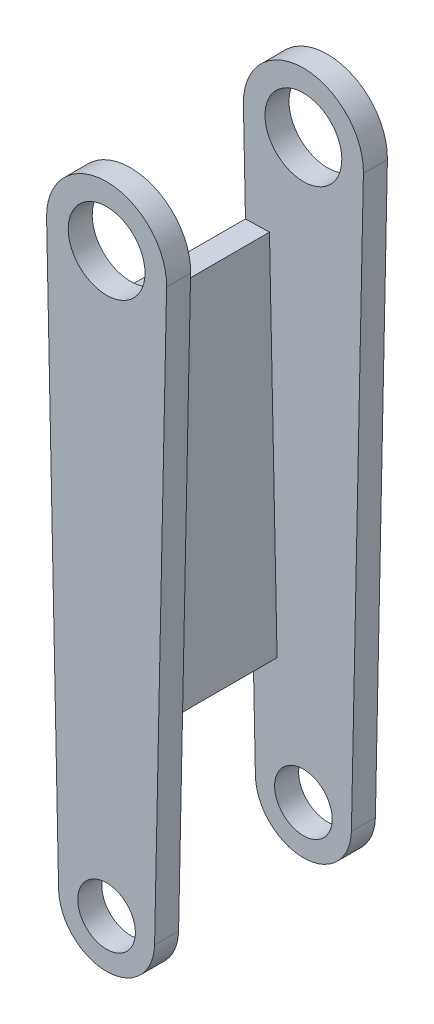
ISO-10303-21;
HEADER;
FILE_DESCRIPTION(('STEP AP214'),'2;1');
FILE_NAME('part.step','',(''),(''),'','','');
FILE_SCHEMA(('AUTOMOTIVE_DESIGN { 1 0 10303 214 1 1 1 1 }'));
ENDSEC;
DATA;
#1=APPLICATION_CONTEXT('core data for automotive mechanical design processes');
#2=APPLICATION_PROTOCOL_DEFINITION('international standard','automotive_design',2000,#1);
#3=PRODUCT_CONTEXT('',#1,'mechanical');
#4=PRODUCT('Part','Part','',(#3));
#5=PRODUCT_RELATED_PRODUCT_CATEGORY('part','',(#4));
#6=PRODUCT_DEFINITION_FORMATION('','',#4);
#7=PRODUCT_DEFINITION_CONTEXT('part definition',#1,'design');
#8=PRODUCT_DEFINITION('design','',#6,#7);
#9=PRODUCT_DEFINITION_SHAPE('','',#8);
#10=(LENGTH_UNIT() NAMED_UNIT(*) SI_UNIT(.MILLI.,.METRE.));
#11=(NAMED_UNIT(*) PLANE_ANGLE_UNIT() SI_UNIT($,.RADIAN.));
#12=(NAMED_UNIT(*) SI_UNIT($,.STERADIAN.) SOLID_ANGLE_UNIT());
#13=UNCERTAINTY_MEASURE_WITH_UNIT(LENGTH_MEASURE(1.E-05),#10,'distance_accuracy_value','');
#14=(GEOMETRIC_REPRESENTATION_CONTEXT(3) GLOBAL_UNCERTAINTY_ASSIGNED_CONTEXT((#13)) GLOBAL_UNIT_ASSIGNED_CONTEXT((#10,
#11,#12)) REPRESENTATION_CONTEXT('',''));
#15=CARTESIAN_POINT('',(0.,0.,0.));
#16=DIRECTION('',(0.,0.,1.));
#17=DIRECTION('',(1.,0.,0.));
#18=AXIS2_PLACEMENT_3D('',#15,#16,#17);
#19=CARTESIAN_POINT('',(0.,120.,46.));
#20=DIRECTION('',(0.,0.,-1.));
#21=DIRECTION('',(-1.,0.,0.));
#22=AXIS2_PLACEMENT_3D('',#19,#20,#21);
#23=CYLINDRICAL_SURFACE('',#22,12.5);
#24=CARTESIAN_POINT('',(0.,120.,5.));
#25=DIRECTION('',(0.,0.,1.));
#26=DIRECTION('',(0.,-1.,0.));
#27=AXIS2_PLACEMENT_3D('',#24,#25,#26);
#28=CIRCLE('',#27,12.5);
#29=CARTESIAN_POINT('',(12.4972870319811,119.739583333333,5.));
#30=VERTEX_POINT('',#29);
#31=CARTESIAN_POINT('',(-12.4972870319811,119.739583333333,5.));
#32=VERTEX_POINT('',#31);
#33=EDGE_CURVE('E216',#30,#32,#28,.T.);
#34=ORIENTED_EDGE('',*,*,#33,.F.);
#35=DIRECTION('',(0.,0.,-1.));
#36=VECTOR('',#35,1.);
#37=CARTESIAN_POINT('',(12.4972870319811,119.739583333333,46.));
#38=LINE('',#37,#36);
#39=CARTESIAN_POINT('',(12.4972870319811,119.739583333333,0.));
#40=VERTEX_POINT('',#39);
#41=EDGE_CURVE('E41',#30,#40,#38,.T.);
#42=ORIENTED_EDGE('',*,*,#41,.T.);
#43=CARTESIAN_POINT('',(0.,120.,0.));
#44=DIRECTION('',(0.,0.,1.));
#45=DIRECTION('',(1.,0.,0.));
#46=AXIS2_PLACEMENT_3D('',#43,#44,#45);
#47=CIRCLE('',#46,12.5);
#48=CARTESIAN_POINT('',(-12.4972870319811,119.739583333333,0.));
#49=VERTEX_POINT('',#48);
#50=EDGE_CURVE('E208',#40,#49,#47,.T.);
#51=ORIENTED_EDGE('',*,*,#50,.T.);
#52=DIRECTION('',(0.,0.,-1.));
#53=VECTOR('',#52,1.);
#54=CARTESIAN_POINT('',(-12.4972870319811,119.739583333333,46.));
#55=LINE('',#54,#53);
#56=EDGE_CURVE('E207',#32,#49,#55,.T.);
#57=ORIENTED_EDGE('',*,*,#56,.F.);
#58=EDGE_LOOP('',(#34,#42,#51,#57));
#59=FACE_BOUND('',#58,.T.);
#60=ADVANCED_FACE('F37',(#59),#23,.T.);
#61=CARTESIAN_POINT('',(-9.99782962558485,-0.208333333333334,46.));
#62=DIRECTION('',(0.999782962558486,0.0208333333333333,0.));
#63=DIRECTION('',(-0.0208333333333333,0.999782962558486,0.));
#64=AXIS2_PLACEMENT_3D('',#61,#62,#63);
#65=PLANE('',#64);
#66=DIRECTION('',(0.0208333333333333,-0.999782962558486,0.));
#67=VECTOR('',#66,1.);
#68=CARTESIAN_POINT('',(-9.99782962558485,-0.208333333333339,5.00000000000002));
#69=LINE('',#68,#67);
#70=CARTESIAN_POINT('',(-12.0702036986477,99.2440326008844,5.));
#71=VERTEX_POINT('',#70);
#72=EDGE_CURVE('E46',#32,#71,#69,.T.);
#73=ORIENTED_EDGE('',*,*,#72,.F.);
#74=ORIENTED_EDGE('',*,*,#56,.T.);
#75=DIRECTION('',(0.0208333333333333,-0.999782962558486,0.));
#76=VECTOR('',#75,1.);
#77=CARTESIAN_POINT('',(-9.99782962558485,-0.208333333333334,0.));
#78=LINE('',#77,#76);
#79=CARTESIAN_POINT('',(-9.99782962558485,-0.208333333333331,0.));
#80=VERTEX_POINT('',#79);
#81=EDGE_CURVE('E204',#49,#80,#78,.T.);
#82=ORIENTED_EDGE('',*,*,#81,.T.);
#83=DIRECTION('',(0.,0.,-1.));
#84=VECTOR('',#83,1.);
#85=CARTESIAN_POINT('',(-9.99782962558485,-0.208333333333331,46.));
#86=LINE('',#85,#84);
#87=CARTESIAN_POINT('',(-9.99782962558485,-0.208333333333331,5.00000000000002));
#88=VERTEX_POINT('',#87);
#89=EDGE_CURVE('E203',#88,#80,#86,.T.);
#90=ORIENTED_EDGE('',*,*,#89,.F.);
#91=CARTESIAN_POINT('',(-10.4868703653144,23.2605274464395,5.00000000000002));
#92=VERTEX_POINT('',#91);
#93=EDGE_CURVE('E218',#92,#88,#69,.T.);
#94=ORIENTED_EDGE('',*,*,#93,.F.);
#95=DIRECTION('',(0.,0.,1.));
#96=VECTOR('',#95,1.);
#97=CARTESIAN_POINT('',(-10.4868703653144,23.2605274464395,5.00000000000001));
#98=LINE('',#97,#96);
#99=CARTESIAN_POINT('',(-10.4868703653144,23.2605274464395,41.));
#100=VERTEX_POINT('',#99);
#101=EDGE_CURVE('E54',#92,#100,#98,.T.);
#102=ORIENTED_EDGE('',*,*,#101,.T.);
#103=DIRECTION('',(-0.0208333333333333,0.999782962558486,0.));
#104=VECTOR('',#103,1.);
#105=CARTESIAN_POINT('',(-9.99782962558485,-0.208333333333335,41.));
#106=LINE('',#105,#104);
#107=CARTESIAN_POINT('',(-9.99782962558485,-0.208333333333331,41.));
#108=VERTEX_POINT('',#107);
#109=EDGE_CURVE('E257',#108,#100,#106,.T.);
#110=ORIENTED_EDGE('',*,*,#109,.F.);
#111=DIRECTION('',(0.,0.,-1.));
#112=VECTOR('',#111,1.);
#113=CARTESIAN_POINT('',(-9.99782962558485,-0.208333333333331,46.));
#114=LINE('',#113,#112);
#115=CARTESIAN_POINT('',(-9.99782962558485,-0.208333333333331,46.));
#116=VERTEX_POINT('',#115);
#117=EDGE_CURVE('E149',#116,#108,#114,.T.);
#118=ORIENTED_EDGE('',*,*,#117,.F.);
#119=DIRECTION('',(0.0208333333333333,-0.999782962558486,0.));
#120=VECTOR('',#119,1.);
#121=CARTESIAN_POINT('',(-9.99782962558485,-0.208333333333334,46.));
#122=LINE('',#121,#120);
#123=CARTESIAN_POINT('',(-12.4972870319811,119.739583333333,46.));
#124=VERTEX_POINT('',#123);
#125=EDGE_CURVE('E271',#124,#116,#122,.T.);
#126=ORIENTED_EDGE('',*,*,#125,.F.);
#127=DIRECTION('',(0.,0.,-1.));
#128=VECTOR('',#127,1.);
#129=CARTESIAN_POINT('',(-12.4972870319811,119.739583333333,46.));
#130=LINE('',#129,#128);
#131=CARTESIAN_POINT('',(-12.4972870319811,119.739583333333,41.));
#132=VERTEX_POINT('',#131);
#133=EDGE_CURVE('E157',#124,#132,#130,.T.);
#134=ORIENTED_EDGE('',*,*,#133,.T.);
#135=CARTESIAN_POINT('',(-12.0702036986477,99.2440326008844,41.));
#136=VERTEX_POINT('',#135);
#137=EDGE_CURVE('E150',#136,#132,#106,.T.);
#138=ORIENTED_EDGE('',*,*,#137,.F.);
#139=DIRECTION('',(0.,0.,-1.));
#140=VECTOR('',#139,1.);
#141=CARTESIAN_POINT('',(-12.0702036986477,99.2440326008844,5.));
#142=LINE('',#141,#140);
#143=EDGE_CURVE('E170',#136,#71,#142,.T.);
#144=ORIENTED_EDGE('',*,*,#143,.T.);
#145=EDGE_LOOP('',(#73,#74,#82,#90,#94,#102,#110,#118,#126,#134,#138,#144));
#146=FACE_BOUND('',#145,.T.);
#147=ADVANCED_FACE('F247',(#146),#65,.F.);
#148=CARTESIAN_POINT('',(0.,0.,46.));
#149=DIRECTION('',(0.,0.,-1.));
#150=DIRECTION('',(-1.,0.,0.));
#151=AXIS2_PLACEMENT_3D('',#148,#149,#150);
#152=CYLINDRICAL_SURFACE('',#151,10.);
#153=CARTESIAN_POINT('',(0.,0.,5.00000000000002));
#154=DIRECTION('',(0.,0.,1.));
#155=DIRECTION('',(0.,-1.,0.));
#156=AXIS2_PLACEMENT_3D('',#153,#154,#155);
#157=CIRCLE('',#156,10.);
#158=CARTESIAN_POINT('',(9.99782962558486,-0.208333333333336,5.00000000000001));
#159=VERTEX_POINT('',#158);
#160=EDGE_CURVE('E11',#88,#159,#157,.T.);
#161=ORIENTED_EDGE('',*,*,#160,.F.);
#162=ORIENTED_EDGE('',*,*,#89,.T.);
#163=CARTESIAN_POINT('',(0.,0.,0.));
#164=DIRECTION('',(0.,0.,1.));
#165=DIRECTION('',(1.,0.,0.));
#166=AXIS2_PLACEMENT_3D('',#163,#164,#165);
#167=CIRCLE('',#166,10.);
#168=CARTESIAN_POINT('',(9.99782962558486,-0.208333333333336,0.));
#169=VERTEX_POINT('',#168);
#170=EDGE_CURVE('E200',#80,#169,#167,.T.);
#171=ORIENTED_EDGE('',*,*,#170,.T.);
#172=DIRECTION('',(0.,0.,-1.));
#173=VECTOR('',#172,1.);
#174=CARTESIAN_POINT('',(9.99782962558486,-0.208333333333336,46.));
#175=LINE('',#174,#173);
#176=EDGE_CURVE('E199',#159,#169,#175,.T.);
#177=ORIENTED_EDGE('',*,*,#176,.F.);
#178=EDGE_LOOP('',(#161,#162,#171,#177));
#179=FACE_BOUND('',#178,.T.);
#180=ADVANCED_FACE('F234',(#179),#152,.T.);
#181=CARTESIAN_POINT('',(12.4972870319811,119.739583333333,46.));
#182=DIRECTION('',(-0.999782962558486,0.0208333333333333,0.));
#183=DIRECTION('',(-0.0208333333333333,-0.999782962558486,0.));
#184=AXIS2_PLACEMENT_3D('',#181,#182,#183);
#185=PLANE('',#184);
#186=DIRECTION('',(-0.0208333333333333,-0.999782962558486,0.));
#187=VECTOR('',#186,1.);
#188=CARTESIAN_POINT('',(13.4468325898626,165.307877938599,5.));
#189=LINE('',#188,#187);
#190=EDGE_CURVE('E61',#30,#159,#189,.T.);
#191=ORIENTED_EDGE('',*,*,#190,.T.);
#192=ORIENTED_EDGE('',*,*,#176,.T.);
#193=DIRECTION('',(0.0208333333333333,0.999782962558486,0.));
#194=VECTOR('',#193,1.);
#195=CARTESIAN_POINT('',(12.4972870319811,119.739583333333,0.));
#196=LINE('',#195,#194);
#197=EDGE_CURVE('E196',#169,#40,#196,.T.);
#198=ORIENTED_EDGE('',*,*,#197,.T.);
#199=ORIENTED_EDGE('',*,*,#41,.F.);
#200=EDGE_LOOP('',(#191,#192,#198,#199));
#201=FACE_BOUND('',#200,.T.);
#202=ADVANCED_FACE('F227',(#201),#185,.F.);
#203=CARTESIAN_POINT('',(0.,0.,46.));
#204=DIRECTION('',(0.,0.,-1.));
#205=DIRECTION('',(-1.,0.,0.));
#206=AXIS2_PLACEMENT_3D('',#203,#204,#205);
#207=CYLINDRICAL_SURFACE('',#206,6.);
#208=CARTESIAN_POINT('',(0.,0.,0.));
#209=DIRECTION('',(0.,0.,1.));
#210=DIRECTION('',(1.,0.,0.));
#211=AXIS2_PLACEMENT_3D('',#208,#209,#210);
#212=CIRCLE('',#211,6.);
#213=CARTESIAN_POINT('',(6.,0.,0.));
#214=VERTEX_POINT('',#213);
#215=EDGE_CURVE('E194',#214,#214,#212,.T.);
#216=ORIENTED_EDGE('',*,*,#215,.F.);
#217=EDGE_LOOP('',(#216));
#218=FACE_BOUND('',#217,.T.);
#219=CARTESIAN_POINT('',(0.,0.,5.00000000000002));
#220=DIRECTION('',(0.,0.,1.));
#221=DIRECTION('',(0.,-1.,0.));
#222=AXIS2_PLACEMENT_3D('',#219,#220,#221);
#223=CIRCLE('',#222,6.);
#224=CARTESIAN_POINT('',(0.,-6.,5.00000000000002));
#225=VERTEX_POINT('',#224);
#226=EDGE_CURVE('E195',#225,#225,#223,.T.);
#227=ORIENTED_EDGE('',*,*,#226,.T.);
#228=EDGE_LOOP('',(#227));
#229=FACE_BOUND('',#228,.T.);
#230=ADVANCED_FACE('F300',(#218,#229),#207,.F.);
#231=CARTESIAN_POINT('',(0.,120.,46.));
#232=DIRECTION('',(0.,0.,-1.));
#233=DIRECTION('',(-1.,0.,0.));
#234=AXIS2_PLACEMENT_3D('',#231,#232,#233);
#235=CYLINDRICAL_SURFACE('',#234,8.00000000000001);
#236=CARTESIAN_POINT('',(0.,120.,0.));
#237=DIRECTION('',(0.,0.,1.));
#238=DIRECTION('',(1.,0.,0.));
#239=AXIS2_PLACEMENT_3D('',#236,#237,#238);
#240=CIRCLE('',#239,8.00000000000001);
#241=CARTESIAN_POINT('',(8.00000000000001,120.,0.));
#242=VERTEX_POINT('',#241);
#243=EDGE_CURVE('E213',#242,#242,#240,.T.);
#244=ORIENTED_EDGE('',*,*,#243,.F.);
#245=EDGE_LOOP('',(#244));
#246=FACE_BOUND('',#245,.T.);
#247=CARTESIAN_POINT('',(0.,120.,5.));
#248=DIRECTION('',(0.,0.,1.));
#249=DIRECTION('',(0.,-1.,0.));
#250=AXIS2_PLACEMENT_3D('',#247,#248,#249);
#251=CIRCLE('',#250,8.00000000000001);
#252=CARTESIAN_POINT('',(0.,112.,5.00000000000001));
#253=VERTEX_POINT('',#252);
#254=EDGE_CURVE('E191',#253,#253,#251,.T.);
#255=ORIENTED_EDGE('',*,*,#254,.T.);
#256=EDGE_LOOP('',(#255));
#257=FACE_BOUND('',#256,.T.);
#258=ADVANCED_FACE('F39',(#246,#257),#235,.F.);
#259=CARTESIAN_POINT('',(0.,120.,0.));
#260=DIRECTION('',(0.,0.,1.));
#261=DIRECTION('',(1.,0.,0.));
#262=AXIS2_PLACEMENT_3D('',#259,#260,#261);
#263=PLANE('',#262);
#264=ORIENTED_EDGE('',*,*,#50,.F.);
#265=ORIENTED_EDGE('',*,*,#197,.F.);
#266=ORIENTED_EDGE('',*,*,#170,.F.);
#267=ORIENTED_EDGE('',*,*,#81,.F.);
#268=EDGE_LOOP('',(#264,#265,#266,#267));
#269=FACE_BOUND('',#268,.T.);
#270=ORIENTED_EDGE('',*,*,#215,.T.);
#271=EDGE_LOOP('',(#270));
#272=FACE_BOUND('',#271,.T.);
#273=ORIENTED_EDGE('',*,*,#243,.T.);
#274=EDGE_LOOP('',(#273));
#275=FACE_BOUND('',#274,.T.);
#276=ADVANCED_FACE('F238',(#269,#272,#275),#263,.F.);
#277=CARTESIAN_POINT('',(-83.5321147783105,167.328711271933,5.));
#278=DIRECTION('',(0.,0.,1.));
#279=DIRECTION('',(0.,-1.,0.));
#280=AXIS2_PLACEMENT_3D('',#277,#278,#279);
#281=PLANE('',#280);
#282=DIRECTION('',(-0.999782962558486,-0.0208333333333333,0.));
#283=VECTOR('',#282,1.);
#284=CARTESIAN_POINT('',(-7.07128888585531,99.3481992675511,5.));
#285=LINE('',#284,#283);
#286=CARTESIAN_POINT('',(-7.07128888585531,99.3481992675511,5.));
#287=VERTEX_POINT('',#286);
#288=EDGE_CURVE('E183',#287,#71,#285,.T.);
#289=ORIENTED_EDGE('',*,*,#288,.F.);
#290=DIRECTION('',(0.0208333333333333,-0.999782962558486,0.));
#291=VECTOR('',#290,1.);
#292=CARTESIAN_POINT('',(-7.07128888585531,99.3481992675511,5.));
#293=LINE('',#292,#291);
#294=CARTESIAN_POINT('',(-5.48795555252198,23.3646941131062,5.00000000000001));
#295=VERTEX_POINT('',#294);
#296=EDGE_CURVE('E166',#287,#295,#293,.T.);
#297=ORIENTED_EDGE('',*,*,#296,.T.);
#298=DIRECTION('',(-0.999782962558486,-0.0208333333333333,0.));
#299=VECTOR('',#298,1.);
#300=CARTESIAN_POINT('',(-5.48795555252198,23.3646941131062,5.00000000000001));
#301=LINE('',#300,#299);
#302=EDGE_CURVE('E179',#295,#92,#301,.T.);
#303=ORIENTED_EDGE('',*,*,#302,.T.);
#304=ORIENTED_EDGE('',*,*,#93,.T.);
#305=ORIENTED_EDGE('',*,*,#160,.T.);
#306=ORIENTED_EDGE('',*,*,#190,.F.);
#307=ORIENTED_EDGE('',*,*,#33,.T.);
#308=ORIENTED_EDGE('',*,*,#72,.T.);
#309=EDGE_LOOP('',(#289,#297,#303,#304,#305,#306,#307,#308));
#310=FACE_BOUND('',#309,.T.);
#311=ORIENTED_EDGE('',*,*,#254,.F.);
#312=EDGE_LOOP('',(#311));
#313=FACE_BOUND('',#312,.T.);
#314=ORIENTED_EDGE('',*,*,#226,.F.);
#315=EDGE_LOOP('',(#314));
#316=FACE_BOUND('',#315,.T.);
#317=ADVANCED_FACE('F244',(#310,#313,#316),#281,.T.);
#318=CARTESIAN_POINT('',(-7.07128888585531,99.3481992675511,5.));
#319=DIRECTION('',(-0.0208333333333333,0.999782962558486,0.));
#320=DIRECTION('',(-0.999782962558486,-0.0208333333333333,0.));
#321=AXIS2_PLACEMENT_3D('',#318,#319,#320);
#322=PLANE('',#321);
#323=ORIENTED_EDGE('',*,*,#143,.F.);
#324=DIRECTION('',(-0.999782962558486,-0.0208333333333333,0.));
#325=VECTOR('',#324,1.);
#326=CARTESIAN_POINT('',(-7.07128888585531,99.3481992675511,41.));
#327=LINE('',#326,#325);
#328=CARTESIAN_POINT('',(-7.07128888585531,99.3481992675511,41.));
#329=VERTEX_POINT('',#328);
#330=EDGE_CURVE('E185',#329,#136,#327,.T.);
#331=ORIENTED_EDGE('',*,*,#330,.F.);
#332=DIRECTION('',(0.,0.,-1.));
#333=VECTOR('',#332,1.);
#334=CARTESIAN_POINT('',(-7.07128888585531,99.3481992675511,5.));
#335=LINE('',#334,#333);
#336=EDGE_CURVE('E176',#329,#287,#335,.T.);
#337=ORIENTED_EDGE('',*,*,#336,.T.);
#338=ORIENTED_EDGE('',*,*,#288,.T.);
#339=EDGE_LOOP('',(#323,#331,#337,#338));
#340=FACE_BOUND('',#339,.T.);
#341=ADVANCED_FACE('F250',(#340),#322,.T.);
#342=CARTESIAN_POINT('',(-5.48795555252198,23.3646941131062,5.00000000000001));
#343=DIRECTION('',(0.0208333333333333,-0.999782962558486,0.));
#344=DIRECTION('',(0.999782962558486,0.0208333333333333,0.));
#345=AXIS2_PLACEMENT_3D('',#342,#343,#344);
#346=PLANE('',#345);
#347=ORIENTED_EDGE('',*,*,#101,.F.);
#348=ORIENTED_EDGE('',*,*,#302,.F.);
#349=DIRECTION('',(0.,0.,1.));
#350=VECTOR('',#349,1.);
#351=CARTESIAN_POINT('',(-5.48795555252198,23.3646941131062,5.00000000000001));
#352=LINE('',#351,#350);
#353=CARTESIAN_POINT('',(-5.48795555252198,23.3646941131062,41.));
#354=VERTEX_POINT('',#353);
#355=EDGE_CURVE('E169',#295,#354,#352,.T.);
#356=ORIENTED_EDGE('',*,*,#355,.T.);
#357=DIRECTION('',(-0.999782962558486,-0.0208333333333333,0.));
#358=VECTOR('',#357,1.);
#359=CARTESIAN_POINT('',(-5.48795555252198,23.3646941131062,41.));
#360=LINE('',#359,#358);
#361=EDGE_CURVE('E188',#354,#100,#360,.T.);
#362=ORIENTED_EDGE('',*,*,#361,.T.);
#363=EDGE_LOOP('',(#347,#348,#356,#362));
#364=FACE_BOUND('',#363,.T.);
#365=ADVANCED_FACE('F255',(#364),#346,.T.);
#366=CARTESIAN_POINT('',(-4.99891481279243,-0.104166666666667,0.));
#367=DIRECTION('',(-0.999782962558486,-0.0208333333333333,0.));
#368=DIRECTION('',(0.0208333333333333,-0.999782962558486,0.));
#369=AXIS2_PLACEMENT_3D('',#366,#367,#368);
#370=PLANE('',#369);
#371=ORIENTED_EDGE('',*,*,#296,.F.);
#372=ORIENTED_EDGE('',*,*,#336,.F.);
#373=DIRECTION('',(-0.0208333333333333,0.999782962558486,0.));
#374=VECTOR('',#373,1.);
#375=CARTESIAN_POINT('',(-7.07128888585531,99.3481992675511,41.));
#376=LINE('',#375,#374);
#377=EDGE_CURVE('E173',#354,#329,#376,.T.);
#378=ORIENTED_EDGE('',*,*,#377,.F.);
#379=ORIENTED_EDGE('',*,*,#355,.F.);
#380=EDGE_LOOP('',(#371,#372,#378,#379));
#381=FACE_BOUND('',#380,.T.);
#382=ADVANCED_FACE('F254',(#381),#370,.F.);
#383=CARTESIAN_POINT('',(-83.5321147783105,167.328711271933,41.));
#384=DIRECTION('',(0.,0.,-1.));
#385=DIRECTION('',(0.,1.,0.));
#386=AXIS2_PLACEMENT_3D('',#383,#384,#385);
#387=PLANE('',#386);
#388=CARTESIAN_POINT('',(0.,0.,41.));
#389=DIRECTION('',(0.,0.,-1.));
#390=DIRECTION('',(0.,1.,0.));
#391=AXIS2_PLACEMENT_3D('',#388,#389,#390);
#392=CIRCLE('',#391,6.);
#393=CARTESIAN_POINT('',(0.,6.,41.));
#394=VERTEX_POINT('',#393);
#395=EDGE_CURVE('E151',#394,#394,#392,.T.);
#396=ORIENTED_EDGE('',*,*,#395,.F.);
#397=EDGE_LOOP('',(#396));
#398=FACE_BOUND('',#397,.T.);
#399=CARTESIAN_POINT('',(0.,120.,41.));
#400=DIRECTION('',(0.,0.,-1.));
#401=DIRECTION('',(0.,1.,0.));
#402=AXIS2_PLACEMENT_3D('',#399,#400,#401);
#403=CIRCLE('',#402,8.00000000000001);
#404=CARTESIAN_POINT('',(0.,128.,41.));
#405=VERTEX_POINT('',#404);
#406=EDGE_CURVE('E139',#405,#405,#403,.T.);
#407=ORIENTED_EDGE('',*,*,#406,.F.);
#408=EDGE_LOOP('',(#407));
#409=FACE_BOUND('',#408,.T.);
#410=ORIENTED_EDGE('',*,*,#361,.F.);
#411=ORIENTED_EDGE('',*,*,#377,.T.);
#412=ORIENTED_EDGE('',*,*,#330,.T.);
#413=ORIENTED_EDGE('',*,*,#137,.T.);
#414=CARTESIAN_POINT('',(0.,120.,41.));
#415=DIRECTION('',(0.,0.,-1.));
#416=DIRECTION('',(0.,1.,0.));
#417=AXIS2_PLACEMENT_3D('',#414,#415,#416);
#418=CIRCLE('',#417,12.5);
#419=CARTESIAN_POINT('',(12.4972870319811,119.739583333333,41.));
#420=VERTEX_POINT('',#419);
#421=EDGE_CURVE('E134',#132,#420,#418,.T.);
#422=ORIENTED_EDGE('',*,*,#421,.T.);
#423=DIRECTION('',(0.0208333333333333,0.999782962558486,0.));
#424=VECTOR('',#423,1.);
#425=CARTESIAN_POINT('',(13.4468325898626,165.307877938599,41.));
#426=LINE('',#425,#424);
#427=CARTESIAN_POINT('',(9.99782962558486,-0.20833333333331,41.));
#428=VERTEX_POINT('',#427);
#429=EDGE_CURVE('E126',#428,#420,#426,.T.);
#430=ORIENTED_EDGE('',*,*,#429,.F.);
#431=CARTESIAN_POINT('',(0.,0.,41.));
#432=DIRECTION('',(0.,0.,-1.));
#433=DIRECTION('',(0.,1.,0.));
#434=AXIS2_PLACEMENT_3D('',#431,#432,#433);
#435=CIRCLE('',#434,10.);
#436=EDGE_CURVE('E131',#428,#108,#435,.T.);
#437=ORIENTED_EDGE('',*,*,#436,.T.);
#438=ORIENTED_EDGE('',*,*,#109,.T.);
#439=EDGE_LOOP('',(#410,#411,#412,#413,#422,#430,#437,#438));
#440=FACE_BOUND('',#439,.T.);
#441=ADVANCED_FACE('F129',(#398,#409,#440),#387,.T.);
#442=CARTESIAN_POINT('',(12.4972870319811,119.739583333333,46.));
#443=DIRECTION('',(-0.999782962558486,0.0208333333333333,0.));
#444=DIRECTION('',(-0.0208333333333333,-0.999782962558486,0.));
#445=AXIS2_PLACEMENT_3D('',#442,#443,#444);
#446=PLANE('',#445);
#447=ORIENTED_EDGE('',*,*,#429,.T.);
#448=DIRECTION('',(0.,0.,-1.));
#449=VECTOR('',#448,1.);
#450=CARTESIAN_POINT('',(12.4972870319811,119.739583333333,46.));
#451=LINE('',#450,#449);
#452=CARTESIAN_POINT('',(12.4972870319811,119.739583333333,46.));
#453=VERTEX_POINT('',#452);
#454=EDGE_CURVE('E155',#453,#420,#451,.T.);
#455=ORIENTED_EDGE('',*,*,#454,.F.);
#456=DIRECTION('',(0.0208333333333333,0.999782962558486,0.));
#457=VECTOR('',#456,1.);
#458=CARTESIAN_POINT('',(12.4972870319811,119.739583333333,46.));
#459=LINE('',#458,#457);
#460=CARTESIAN_POINT('',(9.99782962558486,-0.208333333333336,46.));
#461=VERTEX_POINT('',#460);
#462=EDGE_CURVE('E154',#461,#453,#459,.T.);
#463=ORIENTED_EDGE('',*,*,#462,.F.);
#464=DIRECTION('',(0.,0.,-1.));
#465=VECTOR('',#464,1.);
#466=CARTESIAN_POINT('',(9.99782962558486,-0.208333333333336,46.));
#467=LINE('',#466,#465);
#468=EDGE_CURVE('E146',#461,#428,#467,.T.);
#469=ORIENTED_EDGE('',*,*,#468,.T.);
#470=EDGE_LOOP('',(#447,#455,#463,#469));
#471=FACE_BOUND('',#470,.T.);
#472=ADVANCED_FACE('F153',(#471),#446,.F.);
#473=CARTESIAN_POINT('',(0.,0.,46.));
#474=DIRECTION('',(0.,0.,-1.));
#475=DIRECTION('',(-1.,0.,0.));
#476=AXIS2_PLACEMENT_3D('',#473,#474,#475);
#477=CYLINDRICAL_SURFACE('',#476,10.);
#478=ORIENTED_EDGE('',*,*,#436,.F.);
#479=ORIENTED_EDGE('',*,*,#468,.F.);
#480=CARTESIAN_POINT('',(0.,0.,46.));
#481=DIRECTION('',(0.,0.,1.));
#482=DIRECTION('',(1.,0.,0.));
#483=AXIS2_PLACEMENT_3D('',#480,#481,#482);
#484=CIRCLE('',#483,10.);
#485=EDGE_CURVE('E273',#116,#461,#484,.T.);
#486=ORIENTED_EDGE('',*,*,#485,.F.);
#487=ORIENTED_EDGE('',*,*,#117,.T.);
#488=EDGE_LOOP('',(#478,#479,#486,#487));
#489=FACE_BOUND('',#488,.T.);
#490=ADVANCED_FACE('F144',(#489),#477,.T.);
#491=CARTESIAN_POINT('',(0.,120.,46.));
#492=DIRECTION('',(0.,0.,-1.));
#493=DIRECTION('',(-1.,0.,0.));
#494=AXIS2_PLACEMENT_3D('',#491,#492,#493);
#495=CYLINDRICAL_SURFACE('',#494,12.5);
#496=ORIENTED_EDGE('',*,*,#421,.F.);
#497=ORIENTED_EDGE('',*,*,#133,.F.);
#498=CARTESIAN_POINT('',(0.,120.,46.));
#499=DIRECTION('',(0.,0.,1.));
#500=DIRECTION('',(1.,0.,0.));
#501=AXIS2_PLACEMENT_3D('',#498,#499,#500);
#502=CIRCLE('',#501,12.5);
#503=EDGE_CURVE('E268',#453,#124,#502,.T.);
#504=ORIENTED_EDGE('',*,*,#503,.F.);
#505=ORIENTED_EDGE('',*,*,#454,.T.);
#506=EDGE_LOOP('',(#496,#497,#504,#505));
#507=FACE_BOUND('',#506,.T.);
#508=ADVANCED_FACE('F280',(#507),#495,.T.);
#509=CARTESIAN_POINT('',(0.,0.,46.));
#510=DIRECTION('',(0.,0.,-1.));
#511=DIRECTION('',(-1.,0.,0.));
#512=AXIS2_PLACEMENT_3D('',#509,#510,#511);
#513=CYLINDRICAL_SURFACE('',#512,6.);
#514=CARTESIAN_POINT('',(0.,0.,46.));
#515=DIRECTION('',(0.,0.,1.));
#516=DIRECTION('',(1.,0.,0.));
#517=AXIS2_PLACEMENT_3D('',#514,#515,#516);
#518=CIRCLE('',#517,6.);
#519=CARTESIAN_POINT('',(6.,0.,46.));
#520=VERTEX_POINT('',#519);
#521=EDGE_CURVE('E265',#520,#520,#518,.T.);
#522=ORIENTED_EDGE('',*,*,#521,.T.);
#523=EDGE_LOOP('',(#522));
#524=FACE_BOUND('',#523,.T.);
#525=ORIENTED_EDGE('',*,*,#395,.T.);
#526=EDGE_LOOP('',(#525));
#527=FACE_BOUND('',#526,.T.);
#528=ADVANCED_FACE('F282',(#524,#527),#513,.F.);
#529=CARTESIAN_POINT('',(0.,120.,46.));
#530=DIRECTION('',(0.,0.,1.));
#531=DIRECTION('',(1.,0.,0.));
#532=AXIS2_PLACEMENT_3D('',#529,#530,#531);
#533=PLANE('',#532);
#534=ORIENTED_EDGE('',*,*,#521,.F.);
#535=EDGE_LOOP('',(#534));
#536=FACE_BOUND('',#535,.T.);
#537=ORIENTED_EDGE('',*,*,#503,.T.);
#538=ORIENTED_EDGE('',*,*,#125,.T.);
#539=ORIENTED_EDGE('',*,*,#485,.T.);
#540=ORIENTED_EDGE('',*,*,#462,.T.);
#541=EDGE_LOOP('',(#537,#538,#539,#540));
#542=FACE_BOUND('',#541,.T.);
#543=CARTESIAN_POINT('',(0.,120.,46.));
#544=DIRECTION('',(0.,0.,1.));
#545=DIRECTION('',(1.,0.,0.));
#546=AXIS2_PLACEMENT_3D('',#543,#544,#545);
#547=CIRCLE('',#546,8.00000000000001);
#548=CARTESIAN_POINT('',(8.00000000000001,120.,46.));
#549=VERTEX_POINT('',#548);
#550=EDGE_CURVE('E259',#549,#549,#547,.T.);
#551=ORIENTED_EDGE('',*,*,#550,.F.);
#552=EDGE_LOOP('',(#551));
#553=FACE_BOUND('',#552,.T.);
#554=ADVANCED_FACE('F275',(#536,#542,#553),#533,.T.);
#555=CARTESIAN_POINT('',(0.,120.,46.));
#556=DIRECTION('',(0.,0.,-1.));
#557=DIRECTION('',(-1.,0.,0.));
#558=AXIS2_PLACEMENT_3D('',#555,#556,#557);
#559=CYLINDRICAL_SURFACE('',#558,8.00000000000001);
#560=ORIENTED_EDGE('',*,*,#550,.T.);
#561=EDGE_LOOP('',(#560));
#562=FACE_BOUND('',#561,.T.);
#563=ORIENTED_EDGE('',*,*,#406,.T.);
#564=EDGE_LOOP('',(#563));
#565=FACE_BOUND('',#564,.T.);
#566=ADVANCED_FACE('F372',(#562,#565),#559,.F.);
#567=CLOSED_SHELL('',(#60,#147,#180,#202,#230,#258,#276,#317,#341,#365,#382,#441,#472,#490,#508,
#528,#554,#566));
#568=MANIFOLD_SOLID_BREP('B2',#567);
#569=ADVANCED_BREP_SHAPE_REPRESENTATION('',(#18,#568),#14);
#570=SHAPE_DEFINITION_REPRESENTATION(#9,#569);
ENDSEC;
END-ISO-10303-21;
